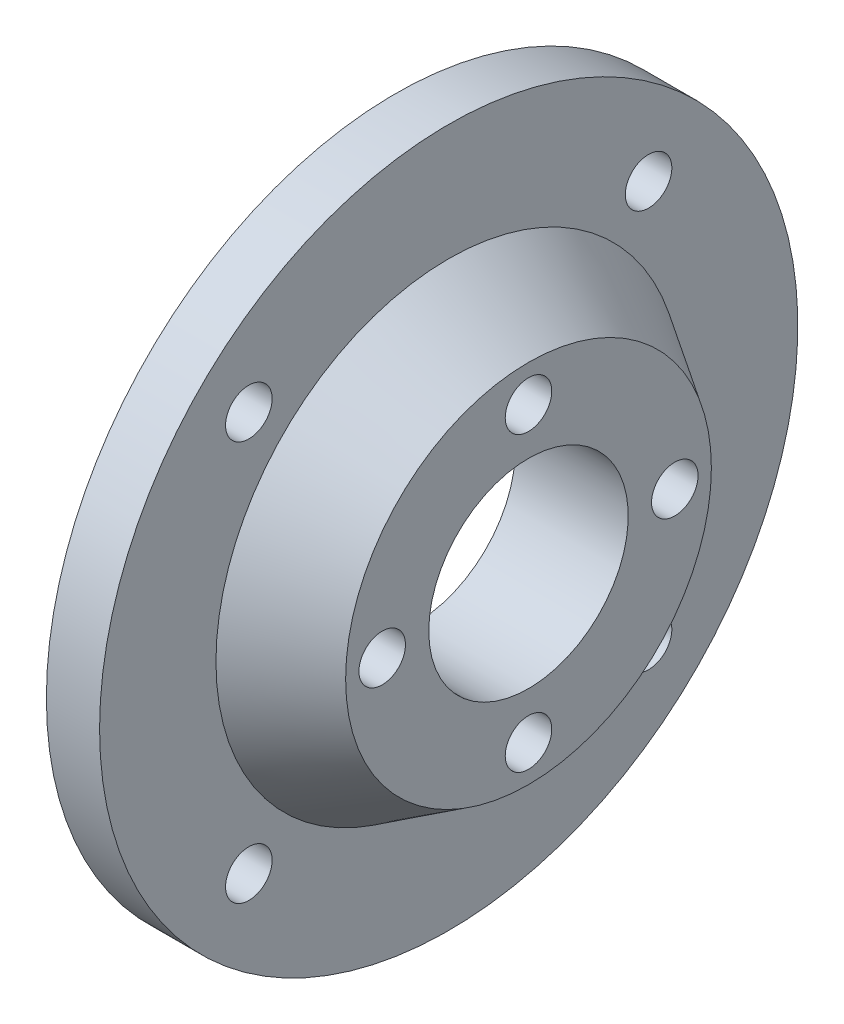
ISO-10303-21;
HEADER;
FILE_DESCRIPTION(('STEP AP214'),'2;1');
FILE_NAME('part.step','',(''),(''),'','','');
FILE_SCHEMA(('AUTOMOTIVE_DESIGN { 1 0 10303 214 1 1 1 1 }'));
ENDSEC;
DATA;
#1=APPLICATION_CONTEXT('core data for automotive mechanical design processes');
#2=APPLICATION_PROTOCOL_DEFINITION('international standard','automotive_design',2000,#1);
#3=PRODUCT_CONTEXT('',#1,'mechanical');
#4=PRODUCT('Part','Part','',(#3));
#5=PRODUCT_RELATED_PRODUCT_CATEGORY('part','',(#4));
#6=PRODUCT_DEFINITION_FORMATION('','',#4);
#7=PRODUCT_DEFINITION_CONTEXT('part definition',#1,'design');
#8=PRODUCT_DEFINITION('design','',#6,#7);
#9=PRODUCT_DEFINITION_SHAPE('','',#8);
#10=(LENGTH_UNIT() NAMED_UNIT(*) SI_UNIT(.MILLI.,.METRE.));
#11=(NAMED_UNIT(*) PLANE_ANGLE_UNIT() SI_UNIT($,.RADIAN.));
#12=(NAMED_UNIT(*) SI_UNIT($,.STERADIAN.) SOLID_ANGLE_UNIT());
#13=UNCERTAINTY_MEASURE_WITH_UNIT(LENGTH_MEASURE(1.E-05),#10,'distance_accuracy_value','');
#14=(GEOMETRIC_REPRESENTATION_CONTEXT(3) GLOBAL_UNCERTAINTY_ASSIGNED_CONTEXT((#13)) GLOBAL_UNIT_ASSIGNED_CONTEXT((#10,
#11,#12)) REPRESENTATION_CONTEXT('',''));
#15=CARTESIAN_POINT('',(0.,0.,0.));
#16=DIRECTION('',(0.,0.,1.));
#17=DIRECTION('',(1.,0.,0.));
#18=AXIS2_PLACEMENT_3D('',#15,#16,#17);
#19=CARTESIAN_POINT('',(0.,52.5,0.));
#20=DIRECTION('',(-1.,0.,0.));
#21=DIRECTION('',(0.,0.,1.));
#22=AXIS2_PLACEMENT_3D('',#19,#20,#21);
#23=PLANE('',#22);
#24=CARTESIAN_POINT('',(0.,0.,-22.));
#25=DIRECTION('',(-1.,0.,0.));
#26=DIRECTION('',(0.,0.,1.));
#27=AXIS2_PLACEMENT_3D('',#24,#25,#26);
#28=CIRCLE('',#27,3.5);
#29=CARTESIAN_POINT('',(0.,0.,-18.5));
#30=VERTEX_POINT('',#29);
#31=EDGE_CURVE('E70',#30,#30,#28,.T.);
#32=ORIENTED_EDGE('',*,*,#31,.T.);
#33=EDGE_LOOP('',(#32));
#34=FACE_BOUND('',#33,.T.);
#35=CARTESIAN_POINT('',(0.,-22.,0.));
#36=DIRECTION('',(-1.,0.,0.));
#37=DIRECTION('',(0.,0.,1.));
#38=AXIS2_PLACEMENT_3D('',#35,#36,#37);
#39=CIRCLE('',#38,3.5);
#40=CARTESIAN_POINT('',(0.,-22.,3.5));
#41=VERTEX_POINT('',#40);
#42=EDGE_CURVE('E67',#41,#41,#39,.T.);
#43=ORIENTED_EDGE('',*,*,#42,.T.);
#44=EDGE_LOOP('',(#43));
#45=FACE_BOUND('',#44,.T.);
#46=CARTESIAN_POINT('',(0.,0.,22.));
#47=DIRECTION('',(-1.,0.,0.));
#48=DIRECTION('',(0.,0.,1.));
#49=AXIS2_PLACEMENT_3D('',#46,#47,#48);
#50=CIRCLE('',#49,3.5);
#51=CARTESIAN_POINT('',(0.,0.,25.5));
#52=VERTEX_POINT('',#51);
#53=EDGE_CURVE('E64',#52,#52,#50,.T.);
#54=ORIENTED_EDGE('',*,*,#53,.T.);
#55=EDGE_LOOP('',(#54));
#56=FACE_BOUND('',#55,.T.);
#57=CARTESIAN_POINT('',(0.,22.,0.));
#58=DIRECTION('',(-1.,0.,0.));
#59=DIRECTION('',(0.,0.,1.));
#60=AXIS2_PLACEMENT_3D('',#57,#58,#59);
#61=CIRCLE('',#60,3.5);
#62=CARTESIAN_POINT('',(0.,22.,3.5));
#63=VERTEX_POINT('',#62);
#64=EDGE_CURVE('E63',#63,#63,#61,.T.);
#65=ORIENTED_EDGE('',*,*,#64,.T.);
#66=EDGE_LOOP('',(#65));
#67=FACE_BOUND('',#66,.T.);
#68=CARTESIAN_POINT('',(0.,0.,0.));
#69=DIRECTION('',(-1.,0.,0.));
#70=DIRECTION('',(0.,0.,1.));
#71=AXIS2_PLACEMENT_3D('',#68,#69,#70);
#72=CIRCLE('',#71,27.5);
#73=CARTESIAN_POINT('',(0.,0.,27.5));
#74=VERTEX_POINT('',#73);
#75=EDGE_CURVE('E55',#74,#74,#72,.F.);
#76=ORIENTED_EDGE('',*,*,#75,.T.);
#77=EDGE_LOOP('',(#76));
#78=FACE_BOUND('',#77,.T.);
#79=CARTESIAN_POINT('',(0.,0.,0.));
#80=DIRECTION('',(-1.,0.,0.));
#81=DIRECTION('',(0.,0.,1.));
#82=AXIS2_PLACEMENT_3D('',#79,#80,#81);
#83=CIRCLE('',#82,15.);
#84=CARTESIAN_POINT('',(0.,0.,15.));
#85=VERTEX_POINT('',#84);
#86=EDGE_CURVE('E10',#85,#85,#83,.T.);
#87=ORIENTED_EDGE('',*,*,#86,.T.);
#88=EDGE_LOOP('',(#87));
#89=FACE_BOUND('',#88,.T.);
#90=ADVANCED_FACE('F33',(#34,#45,#56,#67,#78,#89),#23,.F.);
#91=CARTESIAN_POINT('',(-20.,35.,0.));
#92=DIRECTION('',(1.,0.,0.));
#93=DIRECTION('',(0.,0.,-1.));
#94=AXIS2_PLACEMENT_3D('',#91,#92,#93);
#95=PLANE('',#94);
#96=CARTESIAN_POINT('',(-20.,-30.0520382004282,30.0520382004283));
#97=DIRECTION('',(-1.,0.,0.));
#98=DIRECTION('',(0.,0.,1.));
#99=AXIS2_PLACEMENT_3D('',#96,#97,#98);
#100=CIRCLE('',#99,3.5);
#101=CARTESIAN_POINT('',(-20.,-30.0520382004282,33.5520382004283));
#102=VERTEX_POINT('',#101);
#103=EDGE_CURVE('E123',#102,#102,#100,.T.);
#104=ORIENTED_EDGE('',*,*,#103,.F.);
#105=EDGE_LOOP('',(#104));
#106=FACE_BOUND('',#105,.T.);
#107=CARTESIAN_POINT('',(-20.,30.0520382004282,-30.0520382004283));
#108=DIRECTION('',(-1.,0.,0.));
#109=DIRECTION('',(0.,0.,1.));
#110=AXIS2_PLACEMENT_3D('',#107,#108,#109);
#111=CIRCLE('',#110,3.5);
#112=CARTESIAN_POINT('',(-20.,30.0520382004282,-26.5520382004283));
#113=VERTEX_POINT('',#112);
#114=EDGE_CURVE('E129',#113,#113,#111,.T.);
#115=ORIENTED_EDGE('',*,*,#114,.F.);
#116=EDGE_LOOP('',(#115));
#117=FACE_BOUND('',#116,.T.);
#118=CARTESIAN_POINT('',(-20.,0.,0.));
#119=DIRECTION('',(-1.,0.,0.));
#120=DIRECTION('',(0.,0.,1.));
#121=AXIS2_PLACEMENT_3D('',#118,#119,#120);
#122=CIRCLE('',#121,35.);
#123=CARTESIAN_POINT('',(-20.,0.,35.));
#124=VERTEX_POINT('',#123);
#125=EDGE_CURVE('E46',#124,#124,#122,.T.);
#126=ORIENTED_EDGE('',*,*,#125,.F.);
#127=EDGE_LOOP('',(#126));
#128=FACE_BOUND('',#127,.T.);
#129=CARTESIAN_POINT('',(-20.,0.,0.));
#130=DIRECTION('',(-1.,0.,0.));
#131=DIRECTION('',(0.,0.,1.));
#132=AXIS2_PLACEMENT_3D('',#129,#130,#131);
#133=CIRCLE('',#132,52.5);
#134=CARTESIAN_POINT('',(-20.,0.,52.5));
#135=VERTEX_POINT('',#134);
#136=EDGE_CURVE('E41',#135,#135,#133,.T.);
#137=ORIENTED_EDGE('',*,*,#136,.T.);
#138=EDGE_LOOP('',(#137));
#139=FACE_BOUND('',#138,.T.);
#140=CARTESIAN_POINT('',(-20.,30.0520382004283,30.0520382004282));
#141=DIRECTION('',(-1.,0.,0.));
#142=DIRECTION('',(0.,0.,1.));
#143=AXIS2_PLACEMENT_3D('',#140,#141,#142);
#144=CIRCLE('',#143,3.5);
#145=CARTESIAN_POINT('',(-20.,30.0520382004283,33.5520382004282));
#146=VERTEX_POINT('',#145);
#147=EDGE_CURVE('E126',#146,#146,#144,.T.);
#148=ORIENTED_EDGE('',*,*,#147,.F.);
#149=EDGE_LOOP('',(#148));
#150=FACE_BOUND('',#149,.T.);
#151=CARTESIAN_POINT('',(-20.,-30.0520382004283,-30.0520382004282));
#152=DIRECTION('',(-1.,0.,0.));
#153=DIRECTION('',(0.,0.,1.));
#154=AXIS2_PLACEMENT_3D('',#151,#152,#153);
#155=CIRCLE('',#154,3.5);
#156=CARTESIAN_POINT('',(-20.,-30.0520382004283,-26.5520382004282));
#157=VERTEX_POINT('',#156);
#158=EDGE_CURVE('E58',#157,#157,#155,.T.);
#159=ORIENTED_EDGE('',*,*,#158,.F.);
#160=EDGE_LOOP('',(#159));
#161=FACE_BOUND('',#160,.T.);
#162=ADVANCED_FACE('F142',(#106,#117,#128,#139,#150,#161),#95,.F.);
#163=CARTESIAN_POINT('',(0.,0.,0.));
#164=DIRECTION('',(-1.,0.,0.));
#165=DIRECTION('',(0.,0.,1.));
#166=AXIS2_PLACEMENT_3D('',#163,#164,#165);
#167=CYLINDRICAL_SURFACE('',#166,15.);
#168=ORIENTED_EDGE('',*,*,#86,.F.);
#169=EDGE_LOOP('',(#168));
#170=FACE_BOUND('',#169,.T.);
#171=CARTESIAN_POINT('',(-17.,0.,0.));
#172=DIRECTION('',(-1.,0.,0.));
#173=DIRECTION('',(0.,0.,1.));
#174=AXIS2_PLACEMENT_3D('',#171,#172,#173);
#175=CIRCLE('',#174,15.);
#176=CARTESIAN_POINT('',(-17.,0.,15.));
#177=VERTEX_POINT('',#176);
#178=EDGE_CURVE('E132',#177,#177,#175,.T.);
#179=ORIENTED_EDGE('',*,*,#178,.T.);
#180=EDGE_LOOP('',(#179));
#181=FACE_BOUND('',#180,.T.);
#182=ADVANCED_FACE('F35',(#170,#181),#167,.F.);
#183=CARTESIAN_POINT('',(0.,0.,0.));
#184=DIRECTION('',(-1.,0.,0.));
#185=DIRECTION('',(0.,0.,1.));
#186=AXIS2_PLACEMENT_3D('',#183,#184,#185);
#187=CYLINDRICAL_SURFACE('',#186,52.5);
#188=CARTESIAN_POINT('',(-12.,0.,0.));
#189=DIRECTION('',(-1.,0.,0.));
#190=DIRECTION('',(0.,0.,1.));
#191=AXIS2_PLACEMENT_3D('',#188,#189,#190);
#192=CIRCLE('',#191,52.5);
#193=CARTESIAN_POINT('',(-12.,0.,52.5));
#194=VERTEX_POINT('',#193);
#195=EDGE_CURVE('E59',#194,#194,#192,.T.);
#196=ORIENTED_EDGE('',*,*,#195,.T.);
#197=EDGE_LOOP('',(#196));
#198=FACE_BOUND('',#197,.T.);
#199=ORIENTED_EDGE('',*,*,#136,.F.);
#200=EDGE_LOOP('',(#199));
#201=FACE_BOUND('',#200,.T.);
#202=ADVANCED_FACE('F178',(#198,#201),#187,.T.);
#203=CARTESIAN_POINT('',(0.,0.,0.));
#204=DIRECTION('',(-1.,0.,0.));
#205=DIRECTION('',(0.,0.,1.));
#206=AXIS2_PLACEMENT_3D('',#203,#204,#205);
#207=CYLINDRICAL_SURFACE('',#206,35.);
#208=CARTESIAN_POINT('',(-17.,0.,0.));
#209=DIRECTION('',(-1.,0.,0.));
#210=DIRECTION('',(0.,0.,1.));
#211=AXIS2_PLACEMENT_3D('',#208,#209,#210);
#212=CIRCLE('',#211,35.);
#213=CARTESIAN_POINT('',(-17.,0.,35.));
#214=VERTEX_POINT('',#213);
#215=EDGE_CURVE('E135',#214,#214,#212,.T.);
#216=ORIENTED_EDGE('',*,*,#215,.F.);
#217=EDGE_LOOP('',(#216));
#218=FACE_BOUND('',#217,.T.);
#219=ORIENTED_EDGE('',*,*,#125,.T.);
#220=EDGE_LOOP('',(#219));
#221=FACE_BOUND('',#220,.T.);
#222=ADVANCED_FACE('F140',(#218,#221),#207,.F.);
#223=CARTESIAN_POINT('',(-17.,15.,0.));
#224=DIRECTION('',(1.,0.,0.));
#225=DIRECTION('',(0.,0.,-1.));
#226=AXIS2_PLACEMENT_3D('',#223,#224,#225);
#227=PLANE('',#226);
#228=CARTESIAN_POINT('',(-17.,0.,-22.));
#229=DIRECTION('',(-1.,0.,0.));
#230=DIRECTION('',(0.,0.,1.));
#231=AXIS2_PLACEMENT_3D('',#228,#229,#230);
#232=CIRCLE('',#231,5.);
#233=CARTESIAN_POINT('',(-17.,0.,-17.));
#234=VERTEX_POINT('',#233);
#235=EDGE_CURVE('E85',#234,#234,#232,.T.);
#236=ORIENTED_EDGE('',*,*,#235,.F.);
#237=EDGE_LOOP('',(#236));
#238=FACE_BOUND('',#237,.T.);
#239=CARTESIAN_POINT('',(-17.,-22.,0.));
#240=DIRECTION('',(-1.,0.,0.));
#241=DIRECTION('',(0.,0.,1.));
#242=AXIS2_PLACEMENT_3D('',#239,#240,#241);
#243=CIRCLE('',#242,5.);
#244=CARTESIAN_POINT('',(-17.,-22.,5.));
#245=VERTEX_POINT('',#244);
#246=EDGE_CURVE('E89',#245,#245,#243,.T.);
#247=ORIENTED_EDGE('',*,*,#246,.F.);
#248=EDGE_LOOP('',(#247));
#249=FACE_BOUND('',#248,.T.);
#250=CARTESIAN_POINT('',(-17.,0.,22.));
#251=DIRECTION('',(-1.,0.,0.));
#252=DIRECTION('',(0.,0.,1.));
#253=AXIS2_PLACEMENT_3D('',#250,#251,#252);
#254=CIRCLE('',#253,5.);
#255=CARTESIAN_POINT('',(-17.,0.,27.));
#256=VERTEX_POINT('',#255);
#257=EDGE_CURVE('E95',#256,#256,#254,.T.);
#258=ORIENTED_EDGE('',*,*,#257,.F.);
#259=EDGE_LOOP('',(#258));
#260=FACE_BOUND('',#259,.T.);
#261=CARTESIAN_POINT('',(-17.,22.,0.));
#262=DIRECTION('',(-1.,0.,0.));
#263=DIRECTION('',(0.,0.,1.));
#264=AXIS2_PLACEMENT_3D('',#261,#262,#263);
#265=CIRCLE('',#264,5.);
#266=CARTESIAN_POINT('',(-17.,22.,5.));
#267=VERTEX_POINT('',#266);
#268=EDGE_CURVE('E101',#267,#267,#265,.T.);
#269=ORIENTED_EDGE('',*,*,#268,.F.);
#270=EDGE_LOOP('',(#269));
#271=FACE_BOUND('',#270,.T.);
#272=ORIENTED_EDGE('',*,*,#178,.F.);
#273=EDGE_LOOP('',(#272));
#274=FACE_BOUND('',#273,.T.);
#275=ORIENTED_EDGE('',*,*,#215,.T.);
#276=EDGE_LOOP('',(#275));
#277=FACE_BOUND('',#276,.T.);
#278=ADVANCED_FACE('F184',(#238,#249,#260,#271,#274,#277),#227,.F.);
#279=CARTESIAN_POINT('',(-20.,30.0520382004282,-30.0520382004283));
#280=DIRECTION('',(1.,0.,0.));
#281=DIRECTION('',(0.,0.,-1.));
#282=AXIS2_PLACEMENT_3D('',#279,#280,#281);
#283=CYLINDRICAL_SURFACE('',#282,3.5);
#284=CARTESIAN_POINT('',(-12.,30.0520382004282,-30.0520382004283));
#285=DIRECTION('',(-1.,0.,0.));
#286=DIRECTION('',(0.,0.,1.));
#287=AXIS2_PLACEMENT_3D('',#284,#285,#286);
#288=CIRCLE('',#287,3.5);
#289=CARTESIAN_POINT('',(-12.,30.0520382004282,-26.5520382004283));
#290=VERTEX_POINT('',#289);
#291=EDGE_CURVE('E116',#290,#290,#288,.T.);
#292=ORIENTED_EDGE('',*,*,#291,.F.);
#293=EDGE_LOOP('',(#292));
#294=FACE_BOUND('',#293,.T.);
#295=ORIENTED_EDGE('',*,*,#114,.T.);
#296=EDGE_LOOP('',(#295));
#297=FACE_BOUND('',#296,.T.);
#298=ADVANCED_FACE('F188',(#294,#297),#283,.F.);
#299=CARTESIAN_POINT('',(-20.,30.0520382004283,30.0520382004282));
#300=DIRECTION('',(1.,0.,0.));
#301=DIRECTION('',(0.,0.,-1.));
#302=AXIS2_PLACEMENT_3D('',#299,#300,#301);
#303=CYLINDRICAL_SURFACE('',#302,3.5);
#304=CARTESIAN_POINT('',(-12.,30.0520382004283,30.0520382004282));
#305=DIRECTION('',(-1.,0.,0.));
#306=DIRECTION('',(0.,0.,1.));
#307=AXIS2_PLACEMENT_3D('',#304,#305,#306);
#308=CIRCLE('',#307,3.5);
#309=CARTESIAN_POINT('',(-12.,30.0520382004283,33.5520382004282));
#310=VERTEX_POINT('',#309);
#311=EDGE_CURVE('E113',#310,#310,#308,.T.);
#312=ORIENTED_EDGE('',*,*,#311,.F.);
#313=EDGE_LOOP('',(#312));
#314=FACE_BOUND('',#313,.T.);
#315=ORIENTED_EDGE('',*,*,#147,.T.);
#316=EDGE_LOOP('',(#315));
#317=FACE_BOUND('',#316,.T.);
#318=ADVANCED_FACE('F166',(#314,#317),#303,.F.);
#319=CARTESIAN_POINT('',(-20.,-30.0520382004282,30.0520382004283));
#320=DIRECTION('',(1.,0.,0.));
#321=DIRECTION('',(0.,0.,-1.));
#322=AXIS2_PLACEMENT_3D('',#319,#320,#321);
#323=CYLINDRICAL_SURFACE('',#322,3.5);
#324=CARTESIAN_POINT('',(-12.,-30.0520382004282,30.0520382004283));
#325=DIRECTION('',(-1.,0.,0.));
#326=DIRECTION('',(0.,0.,1.));
#327=AXIS2_PLACEMENT_3D('',#324,#325,#326);
#328=CIRCLE('',#327,3.5);
#329=CARTESIAN_POINT('',(-12.,-30.0520382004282,33.5520382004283));
#330=VERTEX_POINT('',#329);
#331=EDGE_CURVE('E53',#330,#330,#328,.T.);
#332=ORIENTED_EDGE('',*,*,#331,.F.);
#333=EDGE_LOOP('',(#332));
#334=FACE_BOUND('',#333,.T.);
#335=ORIENTED_EDGE('',*,*,#103,.T.);
#336=EDGE_LOOP('',(#335));
#337=FACE_BOUND('',#336,.T.);
#338=ADVANCED_FACE('F156',(#334,#337),#323,.F.);
#339=CARTESIAN_POINT('',(-20.,-30.0520382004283,-30.0520382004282));
#340=DIRECTION('',(1.,0.,0.));
#341=DIRECTION('',(0.,0.,-1.));
#342=AXIS2_PLACEMENT_3D('',#339,#340,#341);
#343=CYLINDRICAL_SURFACE('',#342,3.5);
#344=CARTESIAN_POINT('',(-12.,-30.0520382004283,-30.0520382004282));
#345=DIRECTION('',(-1.,0.,0.));
#346=DIRECTION('',(0.,0.,1.));
#347=AXIS2_PLACEMENT_3D('',#344,#345,#346);
#348=CIRCLE('',#347,3.5);
#349=CARTESIAN_POINT('',(-12.,-30.0520382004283,-26.5520382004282));
#350=VERTEX_POINT('',#349);
#351=EDGE_CURVE('E50',#350,#350,#348,.T.);
#352=ORIENTED_EDGE('',*,*,#351,.F.);
#353=EDGE_LOOP('',(#352));
#354=FACE_BOUND('',#353,.T.);
#355=ORIENTED_EDGE('',*,*,#158,.T.);
#356=EDGE_LOOP('',(#355));
#357=FACE_BOUND('',#356,.T.);
#358=ADVANCED_FACE('F153',(#354,#357),#343,.F.);
#359=CARTESIAN_POINT('',(-12.,0.,0.));
#360=DIRECTION('',(-1.,0.,0.));
#361=DIRECTION('',(0.,0.,1.));
#362=AXIS2_PLACEMENT_3D('',#359,#360,#361);
#363=CONICAL_SURFACE('',#362,35.,0.558599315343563);
#364=CARTESIAN_POINT('',(-12.,0.,0.));
#365=DIRECTION('',(1.,0.,0.));
#366=DIRECTION('',(0.,0.,-1.));
#367=AXIS2_PLACEMENT_3D('',#364,#365,#366);
#368=CIRCLE('',#367,35.);
#369=CARTESIAN_POINT('',(-12.,0.,-35.));
#370=VERTEX_POINT('',#369);
#371=EDGE_CURVE('E54',#370,#370,#368,.T.);
#372=ORIENTED_EDGE('',*,*,#371,.T.);
#373=EDGE_LOOP('',(#372));
#374=FACE_BOUND('',#373,.T.);
#375=ORIENTED_EDGE('',*,*,#75,.F.);
#376=EDGE_LOOP('',(#375));
#377=FACE_BOUND('',#376,.T.);
#378=ADVANCED_FACE('F155',(#374,#377),#363,.T.);
#379=CARTESIAN_POINT('',(-12.,56.864285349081,0.));
#380=DIRECTION('',(-1.,0.,0.));
#381=DIRECTION('',(0.,0.,1.));
#382=AXIS2_PLACEMENT_3D('',#379,#380,#381);
#383=PLANE('',#382);
#384=ORIENTED_EDGE('',*,*,#371,.F.);
#385=EDGE_LOOP('',(#384));
#386=FACE_BOUND('',#385,.T.);
#387=ORIENTED_EDGE('',*,*,#351,.T.);
#388=EDGE_LOOP('',(#387));
#389=FACE_BOUND('',#388,.T.);
#390=ORIENTED_EDGE('',*,*,#331,.T.);
#391=EDGE_LOOP('',(#390));
#392=FACE_BOUND('',#391,.T.);
#393=ORIENTED_EDGE('',*,*,#311,.T.);
#394=EDGE_LOOP('',(#393));
#395=FACE_BOUND('',#394,.T.);
#396=ORIENTED_EDGE('',*,*,#291,.T.);
#397=EDGE_LOOP('',(#396));
#398=FACE_BOUND('',#397,.T.);
#399=ORIENTED_EDGE('',*,*,#195,.F.);
#400=EDGE_LOOP('',(#399));
#401=FACE_BOUND('',#400,.T.);
#402=ADVANCED_FACE('F163',(#386,#389,#392,#395,#398,#401),#383,.F.);
#403=CARTESIAN_POINT('',(-9.,22.,0.));
#404=DIRECTION('',(-1.,0.,0.));
#405=DIRECTION('',(0.,0.,1.));
#406=AXIS2_PLACEMENT_3D('',#403,#404,#405);
#407=CYLINDRICAL_SURFACE('',#406,5.);
#408=CARTESIAN_POINT('',(-9.,22.,0.));
#409=DIRECTION('',(-1.,0.,0.));
#410=DIRECTION('',(0.,0.,1.));
#411=AXIS2_PLACEMENT_3D('',#408,#409,#410);
#412=CIRCLE('',#411,5.);
#413=CARTESIAN_POINT('',(-9.,22.,5.));
#414=VERTEX_POINT('',#413);
#415=EDGE_CURVE('E104',#414,#414,#412,.T.);
#416=ORIENTED_EDGE('',*,*,#415,.F.);
#417=EDGE_LOOP('',(#416));
#418=FACE_BOUND('',#417,.T.);
#419=ORIENTED_EDGE('',*,*,#268,.T.);
#420=EDGE_LOOP('',(#419));
#421=FACE_BOUND('',#420,.T.);
#422=ADVANCED_FACE('F202',(#418,#421),#407,.F.);
#423=CARTESIAN_POINT('',(-9.,22.,0.));
#424=DIRECTION('',(-1.,0.,0.));
#425=DIRECTION('',(0.,0.,1.));
#426=AXIS2_PLACEMENT_3D('',#423,#424,#425);
#427=PLANE('',#426);
#428=CARTESIAN_POINT('',(-9.,22.,0.));
#429=DIRECTION('',(-1.,0.,0.));
#430=DIRECTION('',(0.,0.,1.));
#431=AXIS2_PLACEMENT_3D('',#428,#429,#430);
#432=CIRCLE('',#431,3.5);
#433=CARTESIAN_POINT('',(-9.,22.,3.5));
#434=VERTEX_POINT('',#433);
#435=EDGE_CURVE('E60',#434,#434,#432,.T.);
#436=ORIENTED_EDGE('',*,*,#435,.F.);
#437=EDGE_LOOP('',(#436));
#438=FACE_BOUND('',#437,.T.);
#439=ORIENTED_EDGE('',*,*,#415,.T.);
#440=EDGE_LOOP('',(#439));
#441=FACE_BOUND('',#440,.T.);
#442=ADVANCED_FACE('F214',(#438,#441),#427,.T.);
#443=CARTESIAN_POINT('',(-9.,0.,22.));
#444=DIRECTION('',(-1.,0.,0.));
#445=DIRECTION('',(0.,0.,1.));
#446=AXIS2_PLACEMENT_3D('',#443,#444,#445);
#447=CYLINDRICAL_SURFACE('',#446,5.);
#448=CARTESIAN_POINT('',(-9.,0.,22.));
#449=DIRECTION('',(-1.,0.,0.));
#450=DIRECTION('',(0.,0.,1.));
#451=AXIS2_PLACEMENT_3D('',#448,#449,#450);
#452=CIRCLE('',#451,5.);
#453=CARTESIAN_POINT('',(-9.,0.,27.));
#454=VERTEX_POINT('',#453);
#455=EDGE_CURVE('E98',#454,#454,#452,.T.);
#456=ORIENTED_EDGE('',*,*,#455,.F.);
#457=EDGE_LOOP('',(#456));
#458=FACE_BOUND('',#457,.T.);
#459=ORIENTED_EDGE('',*,*,#257,.T.);
#460=EDGE_LOOP('',(#459));
#461=FACE_BOUND('',#460,.T.);
#462=ADVANCED_FACE('F222',(#458,#461),#447,.F.);
#463=CARTESIAN_POINT('',(-9.,0.,22.));
#464=DIRECTION('',(-1.,0.,0.));
#465=DIRECTION('',(0.,0.,1.));
#466=AXIS2_PLACEMENT_3D('',#463,#464,#465);
#467=PLANE('',#466);
#468=CARTESIAN_POINT('',(-9.,0.,22.));
#469=DIRECTION('',(-1.,0.,0.));
#470=DIRECTION('',(0.,0.,1.));
#471=AXIS2_PLACEMENT_3D('',#468,#469,#470);
#472=CIRCLE('',#471,3.5);
#473=CARTESIAN_POINT('',(-9.,0.,25.5));
#474=VERTEX_POINT('',#473);
#475=EDGE_CURVE('E65',#474,#474,#472,.T.);
#476=ORIENTED_EDGE('',*,*,#475,.F.);
#477=EDGE_LOOP('',(#476));
#478=FACE_BOUND('',#477,.T.);
#479=ORIENTED_EDGE('',*,*,#455,.T.);
#480=EDGE_LOOP('',(#479));
#481=FACE_BOUND('',#480,.T.);
#482=ADVANCED_FACE('F226',(#478,#481),#467,.T.);
#483=CARTESIAN_POINT('',(-9.,-22.,0.));
#484=DIRECTION('',(-1.,0.,0.));
#485=DIRECTION('',(0.,0.,1.));
#486=AXIS2_PLACEMENT_3D('',#483,#484,#485);
#487=CYLINDRICAL_SURFACE('',#486,5.);
#488=CARTESIAN_POINT('',(-9.,-22.,0.));
#489=DIRECTION('',(-1.,0.,0.));
#490=DIRECTION('',(0.,0.,1.));
#491=AXIS2_PLACEMENT_3D('',#488,#489,#490);
#492=CIRCLE('',#491,5.);
#493=CARTESIAN_POINT('',(-9.,-22.,5.));
#494=VERTEX_POINT('',#493);
#495=EDGE_CURVE('E92',#494,#494,#492,.T.);
#496=ORIENTED_EDGE('',*,*,#495,.F.);
#497=EDGE_LOOP('',(#496));
#498=FACE_BOUND('',#497,.T.);
#499=ORIENTED_EDGE('',*,*,#246,.T.);
#500=EDGE_LOOP('',(#499));
#501=FACE_BOUND('',#500,.T.);
#502=ADVANCED_FACE('F230',(#498,#501),#487,.F.);
#503=CARTESIAN_POINT('',(-9.,-22.,0.));
#504=DIRECTION('',(-1.,0.,0.));
#505=DIRECTION('',(0.,0.,1.));
#506=AXIS2_PLACEMENT_3D('',#503,#504,#505);
#507=PLANE('',#506);
#508=CARTESIAN_POINT('',(-9.,-22.,0.));
#509=DIRECTION('',(-1.,0.,0.));
#510=DIRECTION('',(0.,0.,1.));
#511=AXIS2_PLACEMENT_3D('',#508,#509,#510);
#512=CIRCLE('',#511,3.5);
#513=CARTESIAN_POINT('',(-9.,-22.,3.5));
#514=VERTEX_POINT('',#513);
#515=EDGE_CURVE('E68',#514,#514,#512,.T.);
#516=ORIENTED_EDGE('',*,*,#515,.F.);
#517=EDGE_LOOP('',(#516));
#518=FACE_BOUND('',#517,.T.);
#519=ORIENTED_EDGE('',*,*,#495,.T.);
#520=EDGE_LOOP('',(#519));
#521=FACE_BOUND('',#520,.T.);
#522=ADVANCED_FACE('F234',(#518,#521),#507,.T.);
#523=CARTESIAN_POINT('',(-9.,0.,-22.));
#524=DIRECTION('',(-1.,0.,0.));
#525=DIRECTION('',(0.,0.,1.));
#526=AXIS2_PLACEMENT_3D('',#523,#524,#525);
#527=CYLINDRICAL_SURFACE('',#526,5.);
#528=CARTESIAN_POINT('',(-9.,0.,-22.));
#529=DIRECTION('',(-1.,0.,0.));
#530=DIRECTION('',(0.,0.,1.));
#531=AXIS2_PLACEMENT_3D('',#528,#529,#530);
#532=CIRCLE('',#531,5.);
#533=CARTESIAN_POINT('',(-9.,0.,-17.));
#534=VERTEX_POINT('',#533);
#535=EDGE_CURVE('E86',#534,#534,#532,.T.);
#536=ORIENTED_EDGE('',*,*,#535,.F.);
#537=EDGE_LOOP('',(#536));
#538=FACE_BOUND('',#537,.T.);
#539=ORIENTED_EDGE('',*,*,#235,.T.);
#540=EDGE_LOOP('',(#539));
#541=FACE_BOUND('',#540,.T.);
#542=ADVANCED_FACE('F238',(#538,#541),#527,.F.);
#543=CARTESIAN_POINT('',(-9.,0.,-22.));
#544=DIRECTION('',(-1.,0.,0.));
#545=DIRECTION('',(0.,0.,1.));
#546=AXIS2_PLACEMENT_3D('',#543,#544,#545);
#547=PLANE('',#546);
#548=CARTESIAN_POINT('',(-9.,0.,-22.));
#549=DIRECTION('',(-1.,0.,0.));
#550=DIRECTION('',(0.,0.,1.));
#551=AXIS2_PLACEMENT_3D('',#548,#549,#550);
#552=CIRCLE('',#551,3.5);
#553=CARTESIAN_POINT('',(-9.,0.,-18.5));
#554=VERTEX_POINT('',#553);
#555=EDGE_CURVE('E37',#554,#554,#552,.T.);
#556=ORIENTED_EDGE('',*,*,#555,.F.);
#557=EDGE_LOOP('',(#556));
#558=FACE_BOUND('',#557,.T.);
#559=ORIENTED_EDGE('',*,*,#535,.T.);
#560=EDGE_LOOP('',(#559));
#561=FACE_BOUND('',#560,.T.);
#562=ADVANCED_FACE('F242',(#558,#561),#547,.T.);
#563=CARTESIAN_POINT('',(21.,22.,0.));
#564=DIRECTION('',(-1.,0.,0.));
#565=DIRECTION('',(0.,0.,1.));
#566=AXIS2_PLACEMENT_3D('',#563,#564,#565);
#567=CYLINDRICAL_SURFACE('',#566,3.5);
#568=ORIENTED_EDGE('',*,*,#435,.T.);
#569=EDGE_LOOP('',(#568));
#570=FACE_BOUND('',#569,.T.);
#571=ORIENTED_EDGE('',*,*,#64,.F.);
#572=EDGE_LOOP('',(#571));
#573=FACE_BOUND('',#572,.T.);
#574=ADVANCED_FACE('F246',(#570,#573),#567,.F.);
#575=CARTESIAN_POINT('',(21.,0.,22.));
#576=DIRECTION('',(-1.,0.,0.));
#577=DIRECTION('',(0.,0.,1.));
#578=AXIS2_PLACEMENT_3D('',#575,#576,#577);
#579=CYLINDRICAL_SURFACE('',#578,3.5);
#580=ORIENTED_EDGE('',*,*,#475,.T.);
#581=EDGE_LOOP('',(#580));
#582=FACE_BOUND('',#581,.T.);
#583=ORIENTED_EDGE('',*,*,#53,.F.);
#584=EDGE_LOOP('',(#583));
#585=FACE_BOUND('',#584,.T.);
#586=ADVANCED_FACE('F250',(#582,#585),#579,.F.);
#587=CARTESIAN_POINT('',(21.,-22.,0.));
#588=DIRECTION('',(-1.,0.,0.));
#589=DIRECTION('',(0.,0.,1.));
#590=AXIS2_PLACEMENT_3D('',#587,#588,#589);
#591=CYLINDRICAL_SURFACE('',#590,3.5);
#592=ORIENTED_EDGE('',*,*,#515,.T.);
#593=EDGE_LOOP('',(#592));
#594=FACE_BOUND('',#593,.T.);
#595=ORIENTED_EDGE('',*,*,#42,.F.);
#596=EDGE_LOOP('',(#595));
#597=FACE_BOUND('',#596,.T.);
#598=ADVANCED_FACE('F254',(#594,#597),#591,.F.);
#599=CARTESIAN_POINT('',(21.,0.,-22.));
#600=DIRECTION('',(-1.,0.,0.));
#601=DIRECTION('',(0.,0.,1.));
#602=AXIS2_PLACEMENT_3D('',#599,#600,#601);
#603=CYLINDRICAL_SURFACE('',#602,3.5);
#604=ORIENTED_EDGE('',*,*,#555,.T.);
#605=EDGE_LOOP('',(#604));
#606=FACE_BOUND('',#605,.T.);
#607=ORIENTED_EDGE('',*,*,#31,.F.);
#608=EDGE_LOOP('',(#607));
#609=FACE_BOUND('',#608,.T.);
#610=ADVANCED_FACE('F258',(#606,#609),#603,.F.);
#611=CLOSED_SHELL('',(#90,#162,#182,#202,#222,#278,#298,#318,#338,#358,#378,#402,#422,#442,#462,
#482,#502,#522,#542,#562,#574,#586,#598,#610));
#612=MANIFOLD_SOLID_BREP('B2',#611);
#613=ADVANCED_BREP_SHAPE_REPRESENTATION('',(#18,#612),#14);
#614=SHAPE_DEFINITION_REPRESENTATION(#9,#613);
ENDSEC;
END-ISO-10303-21;
